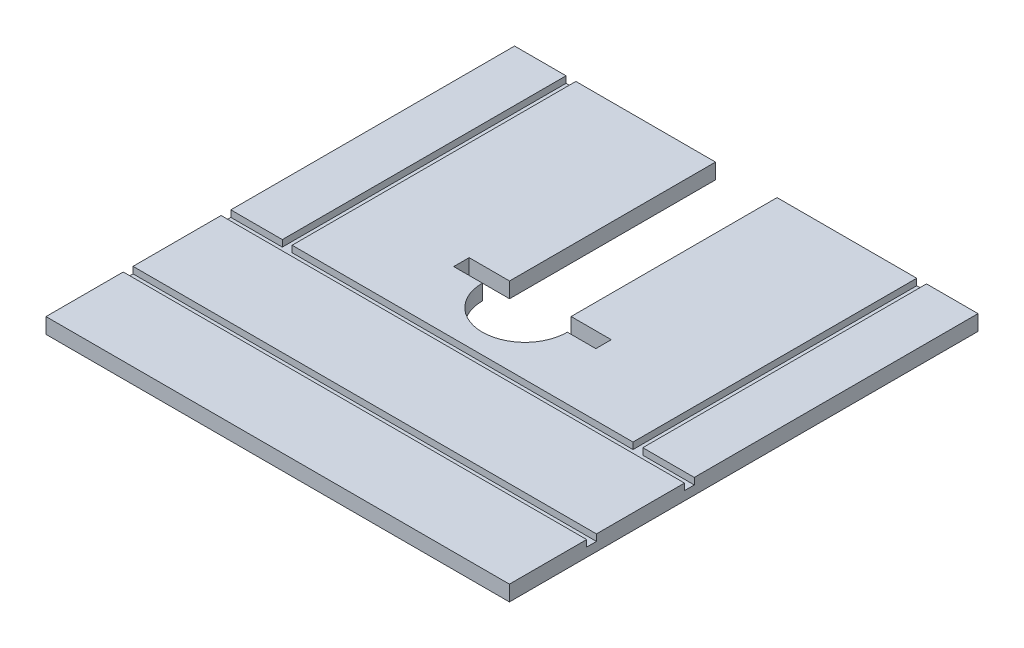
from build123d import *

# Parameters (mm, degrees)
BOSS_EXTRUDE1_DEPTH = 30
SKETCH3_W           = 900
SKETCH3_H           = 19
CUT_EXTRUDE1_DEPTH  = 12.7


with BuildPart() as part:
    # Sketch2 → Boss-Extrude1 (new body)
    with BuildSketch(Plane(origin=(0, 0, 0), x_dir=(1, 0, 0), z_dir=(0, 1, 0))):
        with BuildLine():
            Line((-59.776582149, 430), (-450, 430))
            Line((-450, 430), (-450, -480))
            Line((-450, -480), (450, -480))
            Line((450, -480), (450, 430))
            Line((450, 430), (59.776582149, 430))
            Line((59.776582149, 430), (59.776582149, 30))
            Line((59.776582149, 30), (137.776582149, 30))
            Line((137.776582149, 30), (137.776582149, 0))
            Line((137.776582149, 0), (82.5, 0))
            ThreePointArc((82.5, 0), (0, -82.5), (-82.5, 0))
            Line((-82.5, 0), (-138.223417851, 0))
            Line((-138.223417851, 0), (-138.223417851, 30))
            Line((-138.223417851, 30), (-59.776582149, 30))
            Line((-59.776582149, 30), (-59.776582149, 430))
        make_face()
    extrude(amount=BOSS_EXTRUDE1_DEPTH)

    # Sketch3 → Cut-Extrude1 (cut)
    with BuildSketch(Plane(origin=(0, 30, 0), x_dir=(1, 0, 0), z_dir=(0, 1, 0))):
        with Locations((0, -320.5)):
            Rectangle(SKETCH3_W, SKETCH3_H)
        Polygon((-450, -121), (-350, -121), (-350, 430), (-331, 430), (-331, -121), (331, -121), (331, 430), (350, 430), (350, -121), (450, -121), (450, -140), (-450, -140), align=None)
    extrude(amount=-CUT_EXTRUDE1_DEPTH, mode=Mode.SUBTRACT)


solid = part.part
